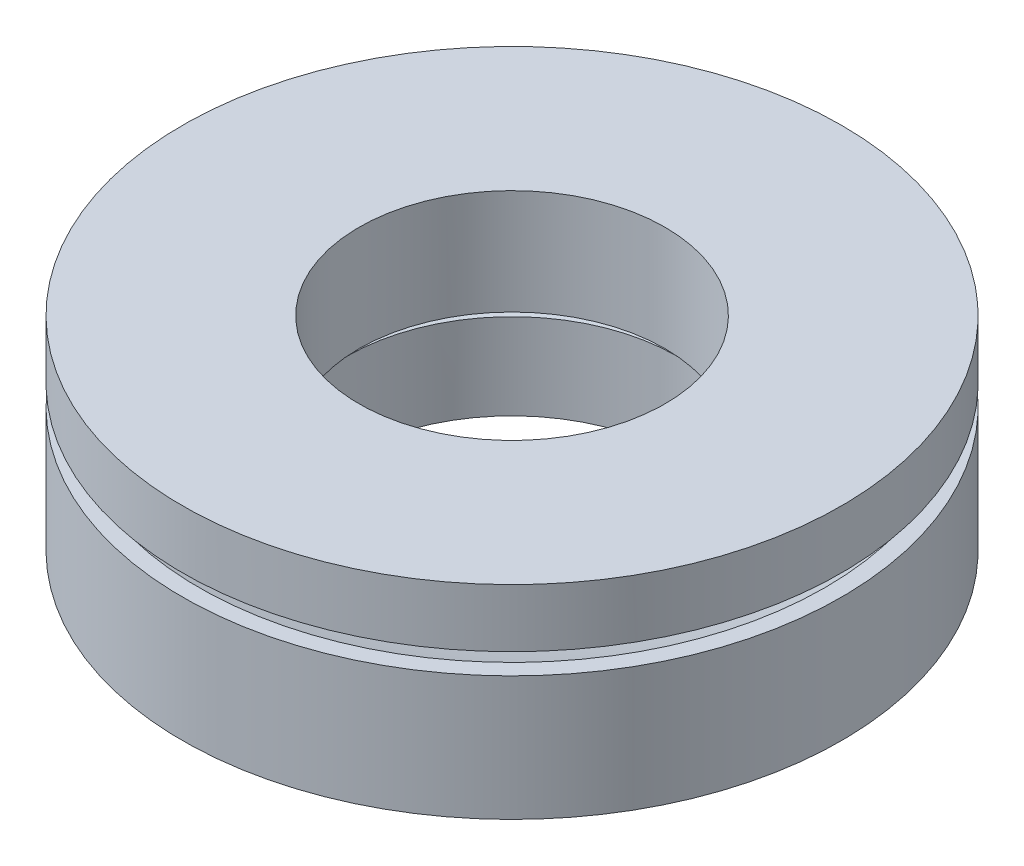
ISO-10303-21;
HEADER;
FILE_DESCRIPTION(('STEP AP214'),'2;1');
FILE_NAME('part.step','',(''),(''),'','','');
FILE_SCHEMA(('AUTOMOTIVE_DESIGN { 1 0 10303 214 1 1 1 1 }'));
ENDSEC;
DATA;
#1=APPLICATION_CONTEXT('core data for automotive mechanical design processes');
#2=APPLICATION_PROTOCOL_DEFINITION('international standard','automotive_design',2000,#1);
#3=PRODUCT_CONTEXT('',#1,'mechanical');
#4=PRODUCT('Part','Part','',(#3));
#5=PRODUCT_RELATED_PRODUCT_CATEGORY('part','',(#4));
#6=PRODUCT_DEFINITION_FORMATION('','',#4);
#7=PRODUCT_DEFINITION_CONTEXT('part definition',#1,'design');
#8=PRODUCT_DEFINITION('design','',#6,#7);
#9=PRODUCT_DEFINITION_SHAPE('','',#8);
#10=(LENGTH_UNIT() NAMED_UNIT(*) SI_UNIT(.MILLI.,.METRE.));
#11=(NAMED_UNIT(*) PLANE_ANGLE_UNIT() SI_UNIT($,.RADIAN.));
#12=(NAMED_UNIT(*) SI_UNIT($,.STERADIAN.) SOLID_ANGLE_UNIT());
#13=UNCERTAINTY_MEASURE_WITH_UNIT(LENGTH_MEASURE(1.E-05),#10,'distance_accuracy_value','');
#14=(GEOMETRIC_REPRESENTATION_CONTEXT(3) GLOBAL_UNCERTAINTY_ASSIGNED_CONTEXT((#13)) GLOBAL_UNIT_ASSIGNED_CONTEXT((#10,
#11,#12)) REPRESENTATION_CONTEXT('',''));
#15=CARTESIAN_POINT('',(0.,0.,0.));
#16=DIRECTION('',(0.,0.,1.));
#17=DIRECTION('',(1.,0.,0.));
#18=AXIS2_PLACEMENT_3D('',#15,#16,#17);
#19=CARTESIAN_POINT('',(-11.1125,0.,0.));
#20=DIRECTION('',(0.,1.,0.));
#21=DIRECTION('',(0.,0.,1.));
#22=AXIS2_PLACEMENT_3D('',#19,#20,#21);
#23=PLANE('',#22);
#24=CARTESIAN_POINT('',(0.,0.,0.));
#25=DIRECTION('',(0.,-1.,0.));
#26=DIRECTION('',(0.,0.,-1.));
#27=AXIS2_PLACEMENT_3D('',#24,#25,#26);
#28=CIRCLE('',#27,5.55625);
#29=CARTESIAN_POINT('',(0.,0.,-5.55625));
#30=VERTEX_POINT('',#29);
#31=EDGE_CURVE('E57',#30,#30,#28,.T.);
#32=ORIENTED_EDGE('',*,*,#31,.F.);
#33=EDGE_LOOP('',(#32));
#34=FACE_BOUND('',#33,.T.);
#35=CARTESIAN_POINT('',(0.,0.,0.));
#36=DIRECTION('',(0.,-1.,0.));
#37=DIRECTION('',(0.,0.,-1.));
#38=AXIS2_PLACEMENT_3D('',#35,#36,#37);
#39=CIRCLE('',#38,11.1125);
#40=CARTESIAN_POINT('',(0.,0.,-11.1125));
#41=VERTEX_POINT('',#40);
#42=EDGE_CURVE('E11',#41,#41,#39,.T.);
#43=ORIENTED_EDGE('',*,*,#42,.T.);
#44=EDGE_LOOP('',(#43));
#45=FACE_BOUND('',#44,.T.);
#46=ADVANCED_FACE('F38',(#34,#45),#23,.F.);
#47=CARTESIAN_POINT('',(0.,0.,0.));
#48=DIRECTION('',(0.,-1.,0.));
#49=DIRECTION('',(0.,0.,-1.));
#50=AXIS2_PLACEMENT_3D('',#47,#48,#49);
#51=CYLINDRICAL_SURFACE('',#50,11.1125);
#52=ORIENTED_EDGE('',*,*,#42,.F.);
#53=EDGE_LOOP('',(#52));
#54=FACE_BOUND('',#53,.T.);
#55=CARTESIAN_POINT('',(0.,4.19221146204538,0.));
#56=DIRECTION('',(0.,-1.,0.));
#57=DIRECTION('',(0.,0.,-1.));
#58=AXIS2_PLACEMENT_3D('',#55,#56,#57);
#59=CIRCLE('',#58,11.1125);
#60=CARTESIAN_POINT('',(0.,4.19221146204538,-11.1125));
#61=VERTEX_POINT('',#60);
#62=EDGE_CURVE('E44',#61,#61,#59,.T.);
#63=ORIENTED_EDGE('',*,*,#62,.T.);
#64=EDGE_LOOP('',(#63));
#65=FACE_BOUND('',#64,.T.);
#66=ADVANCED_FACE('F64',(#54,#65),#51,.T.);
#67=CARTESIAN_POINT('',(-11.1125,4.19221146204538,0.));
#68=DIRECTION('',(0.,-1.,0.));
#69=DIRECTION('',(0.,0.,-1.));
#70=AXIS2_PLACEMENT_3D('',#67,#68,#69);
#71=PLANE('',#70);
#72=ORIENTED_EDGE('',*,*,#62,.F.);
#73=EDGE_LOOP('',(#72));
#74=FACE_BOUND('',#73,.T.);
#75=CARTESIAN_POINT('',(0.,4.19221146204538,0.));
#76=DIRECTION('',(0.,-1.,0.));
#77=DIRECTION('',(0.,0.,-1.));
#78=AXIS2_PLACEMENT_3D('',#75,#76,#77);
#79=CIRCLE('',#78,10.556875);
#80=CARTESIAN_POINT('',(-10.556875,4.19221146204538,0.));
#81=VERTEX_POINT('',#80);
#82=EDGE_CURVE('E48',#81,#81,#79,.T.);
#83=ORIENTED_EDGE('',*,*,#82,.T.);
#84=EDGE_LOOP('',(#83));
#85=FACE_BOUND('',#84,.T.);
#86=ADVANCED_FACE('F68',(#74,#85),#71,.F.);
#87=CARTESIAN_POINT('',(0.,34.6403743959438,0.));
#88=DIRECTION('',(0.,-1.,0.));
#89=DIRECTION('',(-1.,0.,0.));
#90=AXIS2_PLACEMENT_3D('',#87,#88,#89);
#91=SPHERICAL_SURFACE('',#90,32.2263593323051);
#92=CARTESIAN_POINT('',(0.,2.89661403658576,0.));
#93=DIRECTION('',(0.,-1.,0.));
#94=DIRECTION('',(0.,0.,-1.));
#95=AXIS2_PLACEMENT_3D('',#92,#93,#94);
#96=CIRCLE('',#95,5.55624999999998);
#97=CARTESIAN_POINT('',(-5.55624999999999,2.89661403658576,0.));
#98=VERTEX_POINT('',#97);
#99=EDGE_CURVE('E52',#98,#98,#96,.T.);
#100=CARTESIAN_POINT('',(-10.556875,4.19221146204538,0.));
#101=CARTESIAN_POINT('',(-10.5059797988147,4.17456526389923,0.));
#102=CARTESIAN_POINT('',(-10.4550403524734,4.15704667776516,0.));
#103=CARTESIAN_POINT('',(-10.3530742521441,4.1222651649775,0.));
#104=CARTESIAN_POINT('',(-10.3020475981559,4.10500223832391,0.));
#105=CARTESIAN_POINT('',(-10.1999083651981,4.07073247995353,0.));
#106=CARTESIAN_POINT('',(-10.1487957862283,4.05372564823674,0.));
#107=CARTESIAN_POINT('',(-10.0464859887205,4.01996850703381,0.));
#108=CARTESIAN_POINT('',(-9.99528877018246,4.00321819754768,0.));
#109=CARTESIAN_POINT('',(-9.89281098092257,3.96997452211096,0.));
#110=CARTESIAN_POINT('',(-9.84153041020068,3.95348115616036,0.));
#111=CARTESIAN_POINT('',(-9.73888720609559,3.92075178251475,0.));
#112=CARTESIAN_POINT('',(-9.68752457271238,3.90451577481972,0.));
#113=CARTESIAN_POINT('',(-9.58471853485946,3.87230152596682,0.));
#114=CARTESIAN_POINT('',(-9.53327513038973,3.85632328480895,0.));
#115=CARTESIAN_POINT('',(-9.43030884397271,3.82462497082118,0.));
#116=CARTESIAN_POINT('',(-9.37878596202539,3.80890489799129,0.));
#117=CARTESIAN_POINT('',(-9.27566201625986,3.77772331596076,0.));
#118=CARTESIAN_POINT('',(-9.22406095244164,3.76226180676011,0.));
#119=CARTESIAN_POINT('',(-9.12078194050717,3.73159774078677,0.));
#120=CARTESIAN_POINT('',(-9.06910399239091,3.71639518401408,0.));
#121=CARTESIAN_POINT('',(-8.96567251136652,3.68624940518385,0.));
#122=CARTESIAN_POINT('',(-8.91391897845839,3.67130618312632,0.));
#123=CARTESIAN_POINT('',(-8.81033762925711,3.64167944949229,0.));
#124=CARTESIAN_POINT('',(-8.75850981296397,3.62699593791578,0.));
#125=CARTESIAN_POINT('',(-8.65478120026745,3.59788899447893,0.));
#126=CARTESIAN_POINT('',(-8.60288040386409,3.58346556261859,0.));
#127=CARTESIAN_POINT('',(-8.49900713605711,3.55487914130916,0.));
#128=CARTESIAN_POINT('',(-8.4470346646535,3.54071615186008,0.));
#129=CARTESIAN_POINT('',(-8.34301935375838,3.51265097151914,0.));
#130=CARTESIAN_POINT('',(-8.29097651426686,3.49874878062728,0.));
#131=CARTESIAN_POINT('',(-8.18682177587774,3.47120554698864,0.));
#132=CARTESIAN_POINT('',(-8.13470987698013,3.45756450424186,0.));
#133=CARTESIAN_POINT('',(-8.03041833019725,3.43054390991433,0.));
#134=CARTESIAN_POINT('',(-7.97823868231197,3.41716435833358,0.));
#135=CARTESIAN_POINT('',(-7.87381294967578,3.39066708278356,0.));
#136=CARTESIAN_POINT('',(-7.82156686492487,3.37754935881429,0.));
#137=CARTESIAN_POINT('',(-7.71700957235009,3.35157606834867,0.));
#138=CARTESIAN_POINT('',(-7.66469836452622,3.33872050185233,0.));
#139=CARTESIAN_POINT('',(-7.56001214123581,3.31327184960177,0.));
#140=CARTESIAN_POINT('',(-7.50763712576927,3.30067876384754,0.));
#141=CARTESIAN_POINT('',(-7.40282460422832,3.27575538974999,0.));
#142=CARTESIAN_POINT('',(-7.35038709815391,3.26342510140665,0.));
#143=CARTESIAN_POINT('',(-7.24545091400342,3.2390276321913,0.));
#144=CARTESIAN_POINT('',(-7.19295223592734,3.22696045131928,0.));
#145=CARTESIAN_POINT('',(-7.08789502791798,3.20308950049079,0.));
#146=CARTESIAN_POINT('',(-7.03533649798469,3.19128573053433,0.));
#147=CARTESIAN_POINT('',(-6.93016090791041,3.16794189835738,0.));
#148=CARTESIAN_POINT('',(-6.87754384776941,3.1564018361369,0.));
#149=CARTESIAN_POINT('',(-6.772252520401,3.13358570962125,0.));
#150=CARTESIAN_POINT('',(-6.71957825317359,3.12230964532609,0.));
#151=CARTESIAN_POINT('',(-6.61417383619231,3.10002179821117,0.));
#152=CARTESIAN_POINT('',(-6.56144368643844,3.08901001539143,0.));
#153=CARTESIAN_POINT('',(-6.45592883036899,3.06725100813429,0.));
#154=CARTESIAN_POINT('',(-6.4031441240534,3.05650378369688,0.));
#155=CARTESIAN_POINT('',(-6.29752148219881,3.03527416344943,0.));
#156=CARTESIAN_POINT('',(-6.24468354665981,3.02479176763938,0.));
#157=CARTESIAN_POINT('',(-6.138955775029,3.00409206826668,0.));
#158=CARTESIAN_POINT('',(-6.08606593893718,2.99387476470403,0.));
#159=CARTESIAN_POINT('',(-5.98023569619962,2.97370550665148,0.));
#160=CARTESIAN_POINT('',(-5.92729528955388,2.96375355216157,0.));
#161=CARTESIAN_POINT('',(-5.82136523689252,2.9441152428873,0.));
#162=CARTESIAN_POINT('',(-5.7683755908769,2.93442888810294,0.));
#163=CARTESIAN_POINT('',(-5.66234839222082,2.91532202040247,0.));
#164=CARTESIAN_POINT('',(-5.60931083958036,2.90590150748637,0.));
#165=CARTESIAN_POINT('',(-5.55624999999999,2.89661403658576,0.));
#166=B_SPLINE_CURVE_WITH_KNOTS('',3,(#100,#101,#102,#103,#104,#105,#106,#107,#108,#109,#110,
#111,#112,#113,#114,#115,#116,#117,#118,#119,#120,#121,#122,#123,#124,#125,#126,#127,#128,#129,
#130,#131,#132,#133,#134,#135,#136,#137,#138,#139,#140,#141,#142,#143,#144,#145,#146,#147,#148,
#149,#150,#151,#152,#153,#154,#155,#156,#157,#158,#159,#160,#161,#162,#163,#164,#165),
.UNSPECIFIED.,.F.,.F.,(4,2,2,2,2,2,2,2,2,2,2,2,2,2,2,2,2,2,2,2,2,2,2,2,2,2,2,2,2,2,2,2,4),(0.,
0.161602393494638,0.323204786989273,0.484807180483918,0.646409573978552,0.808011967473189,
0.969614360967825,1.13121675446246,1.2928191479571,1.45442154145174,1.61602393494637,
1.77762632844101,1.93922872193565,2.10083111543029,2.26243350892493,2.42403590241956,
2.5856382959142,2.74724068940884,2.90884308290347,3.07044547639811,3.23204786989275,
3.39365026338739,3.55525265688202,3.71685505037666,3.87845744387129,4.04005983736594,
4.20166223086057,4.36326462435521,4.52486701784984,4.68646941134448,4.84807180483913,
5.00967419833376,5.1712765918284),.UNSPECIFIED.);
#167=EDGE_CURVE('BSEAM73',#81,#98,#166,.T.);
#168=ORIENTED_EDGE('',*,*,#82,.F.);
#169=ORIENTED_EDGE('',*,*,#99,.T.);
#170=ORIENTED_EDGE('',*,*,#167,.T.);
#171=ORIENTED_EDGE('',*,*,#167,.F.);
#172=EDGE_LOOP('',(#168,#170,#169,#171));
#173=FACE_BOUND('',#172,.T.);
#174=ADVANCED_FACE('F73',(#173),#91,.F.);
#175=CARTESIAN_POINT('',(0.,0.,0.));
#176=DIRECTION('',(0.,-1.,0.));
#177=DIRECTION('',(0.,0.,-1.));
#178=AXIS2_PLACEMENT_3D('',#175,#176,#177);
#179=CYLINDRICAL_SURFACE('',#178,5.55624999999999);
#180=ORIENTED_EDGE('',*,*,#99,.F.);
#181=EDGE_LOOP('',(#180));
#182=FACE_BOUND('',#181,.T.);
#183=ORIENTED_EDGE('',*,*,#31,.T.);
#184=EDGE_LOOP('',(#183));
#185=FACE_BOUND('',#184,.T.);
#186=ADVANCED_FACE('F61',(#182,#185),#179,.F.);
#187=CLOSED_SHELL('',(#46,#66,#86,#174,#186));
#188=MANIFOLD_SOLID_BREP('B2',#187);
#189=CARTESIAN_POINT('',(-11.1125,6.858,0.));
#190=DIRECTION('',(0.,-1.,0.));
#191=DIRECTION('',(0.,0.,-1.));
#192=AXIS2_PLACEMENT_3D('',#189,#190,#191);
#193=PLANE('',#192);
#194=CARTESIAN_POINT('',(0.,6.858,0.));
#195=DIRECTION('',(0.,-1.,0.));
#196=DIRECTION('',(0.,0.,-1.));
#197=AXIS2_PLACEMENT_3D('',#194,#195,#196);
#198=CIRCLE('',#197,11.1125);
#199=CARTESIAN_POINT('',(0.,6.858,-11.1125));
#200=VERTEX_POINT('',#199);
#201=EDGE_CURVE('E37',#200,#200,#198,.T.);
#202=ORIENTED_EDGE('',*,*,#201,.F.);
#203=EDGE_LOOP('',(#202));
#204=FACE_BOUND('',#203,.T.);
#205=CARTESIAN_POINT('',(0.,6.858,0.));
#206=DIRECTION('',(0.,-1.,0.));
#207=DIRECTION('',(0.,0.,-1.));
#208=AXIS2_PLACEMENT_3D('',#205,#206,#207);
#209=CIRCLE('',#208,5.159375);
#210=CARTESIAN_POINT('',(0.,6.858,-5.159375));
#211=VERTEX_POINT('',#210);
#212=EDGE_CURVE('E128',#211,#211,#209,.T.);
#213=ORIENTED_EDGE('',*,*,#212,.T.);
#214=EDGE_LOOP('',(#213));
#215=FACE_BOUND('',#214,.T.);
#216=ADVANCED_FACE('F114',(#204,#215),#193,.F.);
#217=CARTESIAN_POINT('',(0.,0.,0.));
#218=DIRECTION('',(0.,-1.,0.));
#219=DIRECTION('',(0.,0.,-1.));
#220=AXIS2_PLACEMENT_3D('',#217,#218,#219);
#221=CYLINDRICAL_SURFACE('',#220,11.1125);
#222=CARTESIAN_POINT('',(0.,4.89857142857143,0.));
#223=DIRECTION('',(0.,-1.,0.));
#224=DIRECTION('',(0.,0.,-1.));
#225=AXIS2_PLACEMENT_3D('',#222,#223,#224);
#226=CIRCLE('',#225,11.1125);
#227=CARTESIAN_POINT('',(-11.1125,4.89857142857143,0.));
#228=VERTEX_POINT('',#227);
#229=EDGE_CURVE('E120',#228,#228,#226,.T.);
#230=ORIENTED_EDGE('',*,*,#229,.F.);
#231=EDGE_LOOP('',(#230));
#232=FACE_BOUND('',#231,.T.);
#233=ORIENTED_EDGE('',*,*,#201,.T.);
#234=EDGE_LOOP('',(#233));
#235=FACE_BOUND('',#234,.T.);
#236=ADVANCED_FACE('F143',(#232,#235),#221,.T.);
#237=CARTESIAN_POINT('',(0.,34.6403743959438,0.));
#238=DIRECTION('',(0.,-1.,0.));
#239=DIRECTION('',(-1.,0.,0.));
#240=AXIS2_PLACEMENT_3D('',#237,#238,#239);
#241=SPHERICAL_SURFACE('',#240,31.75);
#242=CARTESIAN_POINT('',(0.,3.3123781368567,0.));
#243=DIRECTION('',(0.,-1.,0.));
#244=DIRECTION('',(0.,0.,-1.));
#245=AXIS2_PLACEMENT_3D('',#242,#243,#244);
#246=CIRCLE('',#245,5.15937500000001);
#247=CARTESIAN_POINT('',(-5.15937500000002,3.3123781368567,0.));
#248=VERTEX_POINT('',#247);
#249=EDGE_CURVE('E124',#248,#248,#246,.T.);
#250=CARTESIAN_POINT('',(-5.15937500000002,3.3123781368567,0.));
#251=CARTESIAN_POINT('',(-5.22279699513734,3.32282303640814,0.));
#252=CARTESIAN_POINT('',(-5.2861872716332,3.33346053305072,0.));
#253=CARTESIAN_POINT('',(-5.41290205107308,3.35512031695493,0.));
#254=CARTESIAN_POINT('',(-5.47622655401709,3.36614260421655,0.));
#255=CARTESIAN_POINT('',(-5.60280745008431,3.3885715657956,0.));
#256=CARTESIAN_POINT('',(-5.66606384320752,3.39997824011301,0.));
#257=CARTESIAN_POINT('',(-5.79250618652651,3.42317555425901,0.));
#258=CARTESIAN_POINT('',(-5.85569213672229,3.43496619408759,0.));
#259=CARTESIAN_POINT('',(-5.98199126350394,3.45893100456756,0.));
#260=CARTESIAN_POINT('',(-6.04510444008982,3.47110517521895,0.));
#261=CARTESIAN_POINT('',(-6.17125569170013,3.49583659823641,0.));
#262=CARTESIAN_POINT('',(-6.23429376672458,3.50839385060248,0.));
#263=CARTESIAN_POINT('',(-6.36029249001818,3.53389097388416,0.));
#264=CARTESIAN_POINT('',(-6.42325313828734,3.54683084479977,0.));
#265=CARTESIAN_POINT('',(-6.54909468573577,3.57309272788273,0.));
#266=CARTESIAN_POINT('',(-6.61197558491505,3.58641474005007,0.));
#267=CARTESIAN_POINT('',(-6.73765531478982,3.61344041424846,0.));
#268=CARTESIAN_POINT('',(-6.80045414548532,3.6271440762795,0.));
#269=CARTESIAN_POINT('',(-6.925967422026,3.65493254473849,0.));
#270=CARTESIAN_POINT('',(-6.98868186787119,3.66901735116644,0.));
#271=CARTESIAN_POINT('',(-7.11402406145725,3.69756758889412,0.));
#272=CARTESIAN_POINT('',(-7.17665180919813,3.71203302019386,0.));
#273=CARTESIAN_POINT('',(-7.30181829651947,3.74134397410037,0.));
#274=CARTESIAN_POINT('',(-7.36435703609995,3.75618949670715,0.));
#275=CARTESIAN_POINT('',(-7.4893432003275,3.78626008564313,0.));
#276=CARTESIAN_POINT('',(-7.55179062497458,3.80148515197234,0.));
#277=CARTESIAN_POINT('',(-7.67659185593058,3.83231426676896,0.));
#278=CARTESIAN_POINT('',(-7.73894566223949,3.84791831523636,0.));
#279=CARTESIAN_POINT('',(-7.86355735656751,3.87950481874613,0.));
#280=CARTESIAN_POINT('',(-7.92581524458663,3.89548727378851,0.));
#281=CARTESIAN_POINT('',(-8.05023280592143,3.92783000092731,0.));
#282=CARTESIAN_POINT('',(-8.11239247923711,3.94419027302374,0.));
#283=CARTESIAN_POINT('',(-8.23661131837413,3.97728803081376,0.));
#284=CARTESIAN_POINT('',(-8.29867048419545,3.99402551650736,0.));
#285=CARTESIAN_POINT('',(-8.42268601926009,4.02787708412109,0.));
#286=CARTESIAN_POINT('',(-8.48464238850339,4.04499116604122,0.));
#287=CARTESIAN_POINT('',(-8.60845004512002,4.0795952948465,0.));
#288=CARTESIAN_POINT('',(-8.67030133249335,4.09708534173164,0.));
#289=CARTESIAN_POINT('',(-8.79389654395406,4.13244075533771,0.));
#290=CARTESIAN_POINT('',(-8.85564046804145,4.15030612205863,0.));
#291=CARTESIAN_POINT('',(-8.97901867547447,4.1864115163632,0.));
#292=CARTESIAN_POINT('',(-9.0406529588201,4.20465154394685,0.));
#293=CARTESIAN_POINT('',(-9.16380961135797,4.24150558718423,0.));
#294=CARTESIAN_POINT('',(-9.22533198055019,4.26011960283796,0.));
#295=CARTESIAN_POINT('',(-9.34826253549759,4.29772093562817,0.));
#296=CARTESIAN_POINT('',(-9.40967072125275,4.31670825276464,0.));
#297=CARTESIAN_POINT('',(-9.53237064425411,4.35505548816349,0.));
#298=CARTESIAN_POINT('',(-9.59366238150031,4.37441540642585,0.));
#299=CARTESIAN_POINT('',(-9.71612714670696,4.4135071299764,0.));
#300=CARTESIAN_POINT('',(-9.77730017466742,4.43323893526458,0.));
#301=CARTESIAN_POINT('',(-9.89952526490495,4.47307370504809,0.));
#302=CARTESIAN_POINT('',(-9.96057732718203,4.49317666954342,0.));
#303=CARTESIAN_POINT('',(-10.0825582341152,4.5337530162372,0.));
#304=CARTESIAN_POINT('',(-10.1434870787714,4.55422639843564,0.));
#305=CARTESIAN_POINT('',(-10.2652193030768,4.59554282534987,0.));
#306=CARTESIAN_POINT('',(-10.3260226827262,4.61638587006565,0.));
#307=CARTESIAN_POINT('',(-10.4475017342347,4.6584408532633,0.));
#308=CARTESIAN_POINT('',(-10.5081774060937,4.67965279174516,0.));
#309=CARTESIAN_POINT('',(-10.6293988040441,4.72244477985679,0.));
#310=CARTESIAN_POINT('',(-10.6899445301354,4.74402482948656,0.));
#311=CARTESIAN_POINT('',(-10.8109038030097,4.78755224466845,0.));
#312=CARTESIAN_POINT('',(-10.8713173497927,4.80949961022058,0.));
#313=CARTESIAN_POINT('',(-10.992010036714,4.85376084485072,0.));
#314=CARTESIAN_POINT('',(-11.0522891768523,4.87607471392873,0.));
#315=CARTESIAN_POINT('',(-11.1125,4.89857142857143,0.));
#316=B_SPLINE_CURVE_WITH_KNOTS('',3,(#250,#251,#252,#253,#254,#255,#256,#257,#258,#259,#260,
#261,#262,#263,#264,#265,#266,#267,#268,#269,#270,#271,#272,#273,#274,#275,#276,#277,#278,#279,
#280,#281,#282,#283,#284,#285,#286,#287,#288,#289,#290,#291,#292,#293,#294,#295,#296,#297,#298,
#299,#300,#301,#302,#303,#304,#305,#306,#307,#308,#309,#310,#311,#312,#313,#314,#315),
.UNSPECIFIED.,.F.,.F.,(4,2,2,2,2,2,2,2,2,2,2,2,2,2,2,2,2,2,2,2,2,2,2,2,2,2,2,2,2,2,2,2,4),(0.,
0.192828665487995,0.38565733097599,0.578485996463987,0.771314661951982,0.964143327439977,
1.15697199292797,1.34980065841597,1.54262932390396,1.73545798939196,1.92828665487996,
2.12111532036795,2.31394398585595,2.50677265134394,2.69960131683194,2.89242998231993,
3.08525864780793,3.27808731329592,3.47091597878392,3.66374464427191,3.85657330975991,
4.04940197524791,4.2422306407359,4.4350593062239,4.62788797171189,4.82071663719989,
5.01354530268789,5.20637396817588,5.39920263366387,5.59203129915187,5.78485996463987,
5.97768863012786,6.17051729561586),.UNSPECIFIED.);
#317=EDGE_CURVE('BSEAM138',#248,#228,#316,.T.);
#318=ORIENTED_EDGE('',*,*,#249,.F.);
#319=ORIENTED_EDGE('',*,*,#229,.T.);
#320=ORIENTED_EDGE('',*,*,#317,.T.);
#321=ORIENTED_EDGE('',*,*,#317,.F.);
#322=EDGE_LOOP('',(#318,#320,#319,#321));
#323=FACE_BOUND('',#322,.T.);
#324=ADVANCED_FACE('F138',(#323),#241,.T.);
#325=CARTESIAN_POINT('',(0.,0.,0.));
#326=DIRECTION('',(0.,-1.,0.));
#327=DIRECTION('',(0.,0.,-1.));
#328=AXIS2_PLACEMENT_3D('',#325,#326,#327);
#329=CYLINDRICAL_SURFACE('',#328,5.15937500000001);
#330=ORIENTED_EDGE('',*,*,#212,.F.);
#331=EDGE_LOOP('',(#330));
#332=FACE_BOUND('',#331,.T.);
#333=ORIENTED_EDGE('',*,*,#249,.T.);
#334=EDGE_LOOP('',(#333));
#335=FACE_BOUND('',#334,.T.);
#336=ADVANCED_FACE('F135',(#332,#335),#329,.F.);
#337=CLOSED_SHELL('',(#216,#236,#324,#336));
#338=MANIFOLD_SOLID_BREP('B6',#337);
#339=ADVANCED_BREP_SHAPE_REPRESENTATION('',(#18,#188,#338),#14);
#340=SHAPE_DEFINITION_REPRESENTATION(#9,#339);
ENDSEC;
END-ISO-10303-21;
